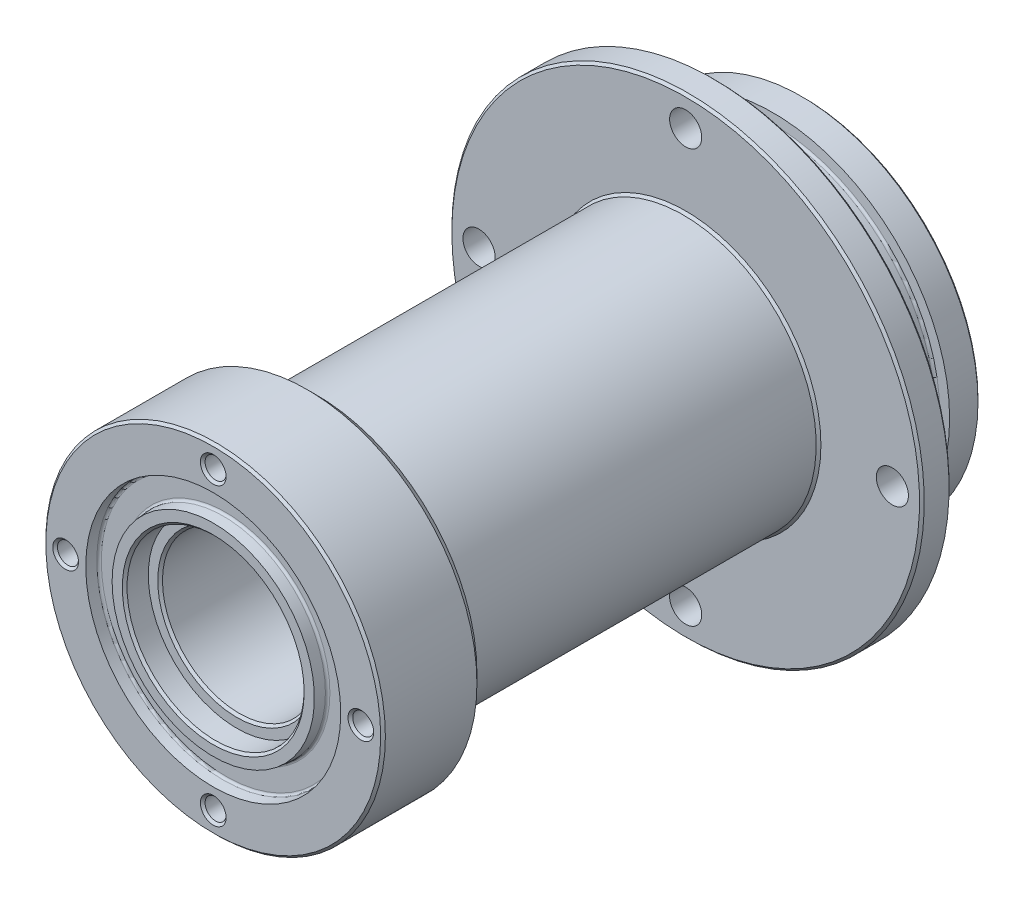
ISO-10303-21;
HEADER;
FILE_DESCRIPTION(('STEP AP214'),'2;1');
FILE_NAME('part.step','',(''),(''),'','','');
FILE_SCHEMA(('AUTOMOTIVE_DESIGN { 1 0 10303 214 1 1 1 1 }'));
ENDSEC;
DATA;
#1=APPLICATION_CONTEXT('core data for automotive mechanical design processes');
#2=APPLICATION_PROTOCOL_DEFINITION('international standard','automotive_design',2000,#1);
#3=PRODUCT_CONTEXT('',#1,'mechanical');
#4=PRODUCT('Part','Part','',(#3));
#5=PRODUCT_RELATED_PRODUCT_CATEGORY('part','',(#4));
#6=PRODUCT_DEFINITION_FORMATION('','',#4);
#7=PRODUCT_DEFINITION_CONTEXT('part definition',#1,'design');
#8=PRODUCT_DEFINITION('design','',#6,#7);
#9=PRODUCT_DEFINITION_SHAPE('','',#8);
#10=(LENGTH_UNIT() NAMED_UNIT(*) SI_UNIT(.MILLI.,.METRE.));
#11=(NAMED_UNIT(*) PLANE_ANGLE_UNIT() SI_UNIT($,.RADIAN.));
#12=(NAMED_UNIT(*) SI_UNIT($,.STERADIAN.) SOLID_ANGLE_UNIT());
#13=UNCERTAINTY_MEASURE_WITH_UNIT(LENGTH_MEASURE(1.E-05),#10,'distance_accuracy_value','');
#14=(GEOMETRIC_REPRESENTATION_CONTEXT(3) GLOBAL_UNCERTAINTY_ASSIGNED_CONTEXT((#13)) GLOBAL_UNIT_ASSIGNED_CONTEXT((#10,
#11,#12)) REPRESENTATION_CONTEXT('',''));
#15=CARTESIAN_POINT('',(0.,0.,0.));
#16=DIRECTION('',(0.,0.,1.));
#17=DIRECTION('',(1.,0.,0.));
#18=AXIS2_PLACEMENT_3D('',#15,#16,#17);
#19=CARTESIAN_POINT('',(0.,0.,63.5));
#20=DIRECTION('',(0.,0.,-1.));
#21=DIRECTION('',(-1.,0.,0.));
#22=AXIS2_PLACEMENT_3D('',#19,#20,#21);
#23=CYLINDRICAL_SURFACE('',#22,7.9883);
#24=CARTESIAN_POINT('',(0.,0.,0.254000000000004));
#25=DIRECTION('',(0.,0.,1.));
#26=DIRECTION('',(1.,0.,0.));
#27=AXIS2_PLACEMENT_3D('',#24,#25,#26);
#28=CIRCLE('',#27,7.9883);
#29=CARTESIAN_POINT('',(7.9883,0.,0.254000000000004));
#30=VERTEX_POINT('',#29);
#31=EDGE_CURVE('E75',#30,#30,#28,.F.);
#32=ORIENTED_EDGE('',*,*,#31,.T.);
#33=EDGE_LOOP('',(#32));
#34=FACE_BOUND('',#33,.T.);
#35=CARTESIAN_POINT('',(0.,0.,19.05));
#36=DIRECTION('',(0.,0.,1.));
#37=DIRECTION('',(1.,0.,0.));
#38=AXIS2_PLACEMENT_3D('',#35,#36,#37);
#39=CIRCLE('',#38,7.9883);
#40=CARTESIAN_POINT('',(7.9883,0.,19.05));
#41=VERTEX_POINT('',#40);
#42=EDGE_CURVE('E50',#41,#41,#39,.T.);
#43=ORIENTED_EDGE('',*,*,#42,.T.);
#44=EDGE_LOOP('',(#43));
#45=FACE_BOUND('',#44,.T.);
#46=ADVANCED_FACE('F32',(#34,#45),#23,.F.);
#47=CARTESIAN_POINT('',(0.,0.,60.96));
#48=DIRECTION('',(0.,0.,1.));
#49=DIRECTION('',(1.,0.,0.));
#50=AXIS2_PLACEMENT_3D('',#47,#48,#49);
#51=PLANE('',#50);
#52=CARTESIAN_POINT('',(0.,0.,60.96));
#53=DIRECTION('',(0.,0.,1.));
#54=DIRECTION('',(1.,0.,0.));
#55=AXIS2_PLACEMENT_3D('',#52,#53,#54);
#56=CIRCLE('',#55,8.509);
#57=CARTESIAN_POINT('',(8.509,0.,60.96));
#58=VERTEX_POINT('',#57);
#59=EDGE_CURVE('E39',#58,#58,#56,.F.);
#60=ORIENTED_EDGE('',*,*,#59,.T.);
#61=EDGE_LOOP('',(#60));
#62=FACE_BOUND('',#61,.T.);
#63=CARTESIAN_POINT('',(0.,0.,60.96));
#64=DIRECTION('',(0.,0.,1.));
#65=DIRECTION('',(1.,0.,0.));
#66=AXIS2_PLACEMENT_3D('',#63,#64,#65);
#67=CIRCLE('',#66,9.525);
#68=CARTESIAN_POINT('',(9.525,0.,60.96));
#69=VERTEX_POINT('',#68);
#70=EDGE_CURVE('E159',#69,#69,#67,.T.);
#71=ORIENTED_EDGE('',*,*,#70,.T.);
#72=EDGE_LOOP('',(#71));
#73=FACE_BOUND('',#72,.T.);
#74=ADVANCED_FACE('F231',(#62,#73),#51,.T.);
#75=CARTESIAN_POINT('',(0.,0.,-3.577141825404));
#76=DIRECTION('',(0.,0.,-1.));
#77=DIRECTION('',(-1.,0.,0.));
#78=AXIS2_PLACEMENT_3D('',#75,#76,#77);
#79=CYLINDRICAL_SURFACE('',#78,18.9865);
#80=CARTESIAN_POINT('',(0.,0.,0.253999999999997));
#81=DIRECTION('',(0.,0.,1.));
#82=DIRECTION('',(1.,0.,0.));
#83=AXIS2_PLACEMENT_3D('',#80,#81,#82);
#84=CIRCLE('',#83,18.9865);
#85=CARTESIAN_POINT('',(18.9865,0.,0.253999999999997));
#86=VERTEX_POINT('',#85);
#87=EDGE_CURVE('E78',#86,#86,#84,.T.);
#88=ORIENTED_EDGE('',*,*,#87,.T.);
#89=EDGE_LOOP('',(#88));
#90=FACE_BOUND('',#89,.T.);
#91=CARTESIAN_POINT('',(0.,0.,3.30520920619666));
#92=DIRECTION('',(0.,0.,-1.));
#93=DIRECTION('',(-1.,0.,0.));
#94=AXIS2_PLACEMENT_3D('',#91,#92,#93);
#95=CIRCLE('',#94,18.9865);
#96=CARTESIAN_POINT('',(-18.9865,0.,3.30520920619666));
#97=VERTEX_POINT('',#96);
#98=EDGE_CURVE('E88',#97,#97,#95,.F.);
#99=ORIENTED_EDGE('',*,*,#98,.F.);
#100=EDGE_LOOP('',(#99));
#101=FACE_BOUND('',#100,.T.);
#102=ADVANCED_FACE('F237',(#90,#101),#79,.T.);
#103=CARTESIAN_POINT('',(0.,0.,63.5));
#104=DIRECTION('',(0.,0.,1.));
#105=DIRECTION('',(1.,0.,0.));
#106=AXIS2_PLACEMENT_3D('',#103,#104,#105);
#107=PLANE('',#106);
#108=CARTESIAN_POINT('',(0.,0.,63.5));
#109=DIRECTION('',(0.,0.,1.));
#110=DIRECTION('',(1.,0.,0.));
#111=AXIS2_PLACEMENT_3D('',#108,#109,#110);
#112=CIRCLE('',#111,9.779);
#113=CARTESIAN_POINT('',(9.779,0.,63.5));
#114=VERTEX_POINT('',#113);
#115=EDGE_CURVE('E101',#114,#114,#112,.F.);
#116=ORIENTED_EDGE('',*,*,#115,.T.);
#117=EDGE_LOOP('',(#116));
#118=FACE_BOUND('',#117,.T.);
#119=CARTESIAN_POINT('',(0.,0.,63.5));
#120=DIRECTION('',(0.,0.,-1.));
#121=DIRECTION('',(-1.,0.,0.));
#122=AXIS2_PLACEMENT_3D('',#119,#120,#121);
#123=CIRCLE('',#122,10.8775303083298);
#124=CARTESIAN_POINT('',(-10.8775303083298,0.,63.5));
#125=VERTEX_POINT('',#124);
#126=EDGE_CURVE('E144',#125,#125,#123,.T.);
#127=ORIENTED_EDGE('',*,*,#126,.F.);
#128=EDGE_LOOP('',(#127));
#129=FACE_BOUND('',#128,.T.);
#130=ADVANCED_FACE('F251',(#118,#129),#107,.T.);
#131=CARTESIAN_POINT('',(-15.875,0.,63.5));
#132=DIRECTION('',(0.,0.,1.));
#133=DIRECTION('',(1.,0.,0.));
#134=AXIS2_PLACEMENT_3D('',#131,#132,#133);
#135=CIRCLE('',#134,1.3843);
#136=CARTESIAN_POINT('',(-14.4907,0.,63.5));
#137=VERTEX_POINT('',#136);
#138=EDGE_CURVE('E123',#137,#137,#135,.F.);
#139=ORIENTED_EDGE('',*,*,#138,.T.);
#140=EDGE_LOOP('',(#139));
#141=FACE_BOUND('',#140,.T.);
#142=CARTESIAN_POINT('',(0.,-15.875,63.5));
#143=DIRECTION('',(0.,0.,1.));
#144=DIRECTION('',(1.,0.,0.));
#145=AXIS2_PLACEMENT_3D('',#142,#143,#144);
#146=CIRCLE('',#145,1.3843);
#147=CARTESIAN_POINT('',(1.3843,-15.875,63.5));
#148=VERTEX_POINT('',#147);
#149=EDGE_CURVE('E126',#148,#148,#146,.F.);
#150=ORIENTED_EDGE('',*,*,#149,.T.);
#151=EDGE_LOOP('',(#150));
#152=FACE_BOUND('',#151,.T.);
#153=CARTESIAN_POINT('',(15.875,0.,63.5));
#154=DIRECTION('',(0.,0.,1.));
#155=DIRECTION('',(1.,0.,0.));
#156=AXIS2_PLACEMENT_3D('',#153,#154,#155);
#157=CIRCLE('',#156,1.3843);
#158=CARTESIAN_POINT('',(17.2593,0.,63.5));
#159=VERTEX_POINT('',#158);
#160=EDGE_CURVE('E129',#159,#159,#157,.F.);
#161=ORIENTED_EDGE('',*,*,#160,.T.);
#162=EDGE_LOOP('',(#161));
#163=FACE_BOUND('',#162,.T.);
#164=CARTESIAN_POINT('',(0.,15.875,63.5));
#165=DIRECTION('',(0.,0.,1.));
#166=DIRECTION('',(1.,0.,0.));
#167=AXIS2_PLACEMENT_3D('',#164,#165,#166);
#168=CIRCLE('',#167,1.3843);
#169=CARTESIAN_POINT('',(1.3843,15.875,63.5));
#170=VERTEX_POINT('',#169);
#171=EDGE_CURVE('E132',#170,#170,#168,.F.);
#172=ORIENTED_EDGE('',*,*,#171,.T.);
#173=EDGE_LOOP('',(#172));
#174=FACE_BOUND('',#173,.T.);
#175=CARTESIAN_POINT('',(0.,0.,63.5));
#176=DIRECTION('',(0.,0.,1.));
#177=DIRECTION('',(1.,0.,0.));
#178=AXIS2_PLACEMENT_3D('',#175,#176,#177);
#179=CIRCLE('',#178,18.00225);
#180=CARTESIAN_POINT('',(18.00225,0.,63.5));
#181=VERTEX_POINT('',#180);
#182=EDGE_CURVE('E135',#181,#181,#179,.T.);
#183=ORIENTED_EDGE('',*,*,#182,.T.);
#184=EDGE_LOOP('',(#183));
#185=FACE_BOUND('',#184,.T.);
#186=CARTESIAN_POINT('',(0.,0.,63.5));
#187=DIRECTION('',(0.,0.,-1.));
#188=DIRECTION('',(-1.,0.,0.));
#189=AXIS2_PLACEMENT_3D('',#186,#187,#188);
#190=CIRCLE('',#189,13.7096696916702);
#191=CARTESIAN_POINT('',(-13.7096696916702,0.,63.5));
#192=VERTEX_POINT('',#191);
#193=EDGE_CURVE('E147',#192,#192,#190,.T.);
#194=ORIENTED_EDGE('',*,*,#193,.T.);
#195=EDGE_LOOP('',(#194));
#196=FACE_BOUND('',#195,.T.);
#197=ADVANCED_FACE('F248',(#141,#152,#163,#174,#185,#196),#107,.T.);
#198=CARTESIAN_POINT('',(0.,0.,0.));
#199=DIRECTION('',(0.,0.,1.));
#200=DIRECTION('',(1.,0.,0.));
#201=AXIS2_PLACEMENT_3D('',#198,#199,#200);
#202=PLANE('',#201);
#203=CARTESIAN_POINT('',(0.,0.,0.));
#204=DIRECTION('',(0.,0.,1.));
#205=DIRECTION('',(1.,0.,0.));
#206=AXIS2_PLACEMENT_3D('',#203,#204,#205);
#207=CIRCLE('',#206,18.7325);
#208=CARTESIAN_POINT('',(18.7325,0.,0.));
#209=VERTEX_POINT('',#208);
#210=EDGE_CURVE('E81',#209,#209,#207,.F.);
#211=ORIENTED_EDGE('',*,*,#210,.T.);
#212=EDGE_LOOP('',(#211));
#213=FACE_BOUND('',#212,.T.);
#214=CARTESIAN_POINT('',(0.,0.,0.));
#215=DIRECTION('',(0.,0.,1.));
#216=DIRECTION('',(1.,0.,0.));
#217=AXIS2_PLACEMENT_3D('',#214,#215,#216);
#218=CIRCLE('',#217,8.2423);
#219=CARTESIAN_POINT('',(8.2423,0.,0.));
#220=VERTEX_POINT('',#219);
#221=EDGE_CURVE('E84',#220,#220,#218,.T.);
#222=ORIENTED_EDGE('',*,*,#221,.T.);
#223=EDGE_LOOP('',(#222));
#224=FACE_BOUND('',#223,.T.);
#225=ADVANCED_FACE('F244',(#213,#224),#202,.F.);
#226=CARTESIAN_POINT('',(0.,0.,63.5));
#227=DIRECTION('',(0.,0.,-1.));
#228=DIRECTION('',(-1.,0.,0.));
#229=AXIS2_PLACEMENT_3D('',#226,#227,#228);
#230=CYLINDRICAL_SURFACE('',#229,18.25625);
#231=CARTESIAN_POINT('',(0.,0.,53.4035));
#232=DIRECTION('',(0.,0.,1.));
#233=DIRECTION('',(1.,0.,0.));
#234=AXIS2_PLACEMENT_3D('',#231,#232,#233);
#235=CIRCLE('',#234,18.25625);
#236=CARTESIAN_POINT('',(18.25625,0.,53.4035));
#237=VERTEX_POINT('',#236);
#238=EDGE_CURVE('E98',#237,#237,#235,.T.);
#239=ORIENTED_EDGE('',*,*,#238,.T.);
#240=EDGE_LOOP('',(#239));
#241=FACE_BOUND('',#240,.T.);
#242=CARTESIAN_POINT('',(0.,0.,63.246));
#243=DIRECTION('',(0.,0.,1.));
#244=DIRECTION('',(1.,0.,0.));
#245=AXIS2_PLACEMENT_3D('',#242,#243,#244);
#246=CIRCLE('',#245,18.25625);
#247=CARTESIAN_POINT('',(18.25625,0.,63.246));
#248=VERTEX_POINT('',#247);
#249=EDGE_CURVE('E111',#248,#248,#246,.F.);
#250=ORIENTED_EDGE('',*,*,#249,.T.);
#251=EDGE_LOOP('',(#250));
#252=FACE_BOUND('',#251,.T.);
#253=ADVANCED_FACE('F247',(#241,#252),#230,.T.);
#254=CARTESIAN_POINT('',(0.,15.875,50.8));
#255=DIRECTION('',(0.,0.,1.));
#256=DIRECTION('',(1.,0.,0.));
#257=AXIS2_PLACEMENT_3D('',#254,#255,#256);
#258=CYLINDRICAL_SURFACE('',#257,1.1303);
#259=CARTESIAN_POINT('',(0.,15.875,52.3875));
#260=DIRECTION('',(0.,0.,1.));
#261=DIRECTION('',(1.,0.,0.));
#262=AXIS2_PLACEMENT_3D('',#259,#260,#261);
#263=CIRCLE('',#262,1.1303);
#264=CARTESIAN_POINT('',(1.1303,15.875,52.3875));
#265=VERTEX_POINT('',#264);
#266=EDGE_CURVE('E162',#265,#265,#263,.F.);
#267=ORIENTED_EDGE('',*,*,#266,.T.);
#268=EDGE_LOOP('',(#267));
#269=FACE_BOUND('',#268,.T.);
#270=CARTESIAN_POINT('',(0.,15.875,63.246));
#271=DIRECTION('',(0.,0.,1.));
#272=DIRECTION('',(1.,0.,0.));
#273=AXIS2_PLACEMENT_3D('',#270,#271,#272);
#274=CIRCLE('',#273,1.1303);
#275=CARTESIAN_POINT('',(1.1303,15.875,63.246));
#276=VERTEX_POINT('',#275);
#277=EDGE_CURVE('E114',#276,#276,#274,.T.);
#278=ORIENTED_EDGE('',*,*,#277,.T.);
#279=EDGE_LOOP('',(#278));
#280=FACE_BOUND('',#279,.T.);
#281=ADVANCED_FACE('F242',(#269,#280),#258,.F.);
#282=CARTESIAN_POINT('',(15.875,0.,50.8));
#283=DIRECTION('',(0.,0.,1.));
#284=DIRECTION('',(1.,0.,0.));
#285=AXIS2_PLACEMENT_3D('',#282,#283,#284);
#286=CYLINDRICAL_SURFACE('',#285,1.1303);
#287=CARTESIAN_POINT('',(15.875,0.,52.3875));
#288=DIRECTION('',(0.,0.,1.));
#289=DIRECTION('',(1.,0.,0.));
#290=AXIS2_PLACEMENT_3D('',#287,#288,#289);
#291=CIRCLE('',#290,1.1303);
#292=CARTESIAN_POINT('',(17.0053,0.,52.3875));
#293=VERTEX_POINT('',#292);
#294=EDGE_CURVE('E165',#293,#293,#291,.F.);
#295=ORIENTED_EDGE('',*,*,#294,.T.);
#296=EDGE_LOOP('',(#295));
#297=FACE_BOUND('',#296,.T.);
#298=CARTESIAN_POINT('',(15.875,0.,63.246));
#299=DIRECTION('',(0.,0.,1.));
#300=DIRECTION('',(1.,0.,0.));
#301=AXIS2_PLACEMENT_3D('',#298,#299,#300);
#302=CIRCLE('',#301,1.1303);
#303=CARTESIAN_POINT('',(17.0053,0.,63.246));
#304=VERTEX_POINT('',#303);
#305=EDGE_CURVE('E117',#304,#304,#302,.T.);
#306=ORIENTED_EDGE('',*,*,#305,.T.);
#307=EDGE_LOOP('',(#306));
#308=FACE_BOUND('',#307,.T.);
#309=ADVANCED_FACE('F258',(#297,#308),#286,.F.);
#310=CARTESIAN_POINT('',(0.,-15.875,50.8));
#311=DIRECTION('',(0.,0.,1.));
#312=DIRECTION('',(1.,0.,0.));
#313=AXIS2_PLACEMENT_3D('',#310,#311,#312);
#314=CYLINDRICAL_SURFACE('',#313,1.1303);
#315=CARTESIAN_POINT('',(0.,-15.875,52.3875));
#316=DIRECTION('',(0.,0.,1.));
#317=DIRECTION('',(1.,0.,0.));
#318=AXIS2_PLACEMENT_3D('',#315,#316,#317);
#319=CIRCLE('',#318,1.1303);
#320=CARTESIAN_POINT('',(1.1303,-15.875,52.3875));
#321=VERTEX_POINT('',#320);
#322=EDGE_CURVE('E105',#321,#321,#319,.F.);
#323=ORIENTED_EDGE('',*,*,#322,.T.);
#324=EDGE_LOOP('',(#323));
#325=FACE_BOUND('',#324,.T.);
#326=CARTESIAN_POINT('',(0.,-15.875,63.246));
#327=DIRECTION('',(0.,0.,1.));
#328=DIRECTION('',(1.,0.,0.));
#329=AXIS2_PLACEMENT_3D('',#326,#327,#328);
#330=CIRCLE('',#329,1.1303);
#331=CARTESIAN_POINT('',(1.1303,-15.875,63.246));
#332=VERTEX_POINT('',#331);
#333=EDGE_CURVE('E120',#332,#332,#330,.T.);
#334=ORIENTED_EDGE('',*,*,#333,.T.);
#335=EDGE_LOOP('',(#334));
#336=FACE_BOUND('',#335,.T.);
#337=ADVANCED_FACE('F338',(#325,#336),#314,.F.);
#338=CARTESIAN_POINT('',(-15.875,0.,50.8));
#339=DIRECTION('',(0.,0.,1.));
#340=DIRECTION('',(1.,0.,0.));
#341=AXIS2_PLACEMENT_3D('',#338,#339,#340);
#342=CYLINDRICAL_SURFACE('',#341,1.1303);
#343=CARTESIAN_POINT('',(-15.875,0.,52.3875));
#344=DIRECTION('',(0.,0.,1.));
#345=DIRECTION('',(1.,0.,0.));
#346=AXIS2_PLACEMENT_3D('',#343,#344,#345);
#347=CIRCLE('',#346,1.1303);
#348=CARTESIAN_POINT('',(-14.7447,0.,52.3875));
#349=VERTEX_POINT('',#348);
#350=EDGE_CURVE('E102',#349,#349,#347,.F.);
#351=ORIENTED_EDGE('',*,*,#350,.T.);
#352=EDGE_LOOP('',(#351));
#353=FACE_BOUND('',#352,.T.);
#354=CARTESIAN_POINT('',(-15.875,0.,63.246));
#355=DIRECTION('',(0.,0.,1.));
#356=DIRECTION('',(1.,0.,0.));
#357=AXIS2_PLACEMENT_3D('',#354,#355,#356);
#358=CIRCLE('',#357,1.1303);
#359=CARTESIAN_POINT('',(-14.7447,0.,63.246));
#360=VERTEX_POINT('',#359);
#361=EDGE_CURVE('E138',#360,#360,#358,.T.);
#362=ORIENTED_EDGE('',*,*,#361,.T.);
#363=EDGE_LOOP('',(#362));
#364=FACE_BOUND('',#363,.T.);
#365=ADVANCED_FACE('F298',(#353,#364),#342,.F.);
#366=CARTESIAN_POINT('',(0.,0.,62.4332));
#367=DIRECTION('',(0.,0.,-1.));
#368=DIRECTION('',(-1.,0.,0.));
#369=AXIS2_PLACEMENT_3D('',#366,#367,#368);
#370=TOROIDAL_SURFACE('',#369,11.2258334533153,0.253999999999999);
#371=CARTESIAN_POINT('',(0.,0.,62.1792));
#372=DIRECTION('',(0.,0.,-1.));
#373=DIRECTION('',(-1.,0.,0.));
#374=AXIS2_PLACEMENT_3D('',#371,#372,#373);
#375=CIRCLE('',#374,11.2258334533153);
#376=CARTESIAN_POINT('',(-11.2258334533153,0.,62.1792));
#377=VERTEX_POINT('',#376);
#378=EDGE_CURVE('E156',#377,#377,#375,.T.);
#379=ORIENTED_EDGE('',*,*,#378,.F.);
#380=EDGE_LOOP('',(#379));
#381=FACE_BOUND('',#380,.T.);
#382=CARTESIAN_POINT('',(0.,0.,62.4110624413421));
#383=DIRECTION('',(0.,0.,-1.));
#384=DIRECTION('',(-1.,0.,0.));
#385=AXIS2_PLACEMENT_3D('',#382,#383,#384);
#386=CIRCLE('',#385,10.9728);
#387=CARTESIAN_POINT('',(-10.9728,0.,62.4110624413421));
#388=VERTEX_POINT('',#387);
#389=EDGE_CURVE('E141',#388,#388,#386,.T.);
#390=ORIENTED_EDGE('',*,*,#389,.T.);
#391=EDGE_LOOP('',(#390));
#392=FACE_BOUND('',#391,.T.);
#393=ADVANCED_FACE('F295',(#381,#392),#370,.F.);
#394=CARTESIAN_POINT('',(0.,0.,63.5));
#395=DIRECTION('',(0.,0.,-1.));
#396=DIRECTION('',(-1.,0.,0.));
#397=AXIS2_PLACEMENT_3D('',#394,#395,#396);
#398=CONICAL_SURFACE('',#397,10.8775303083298,0.0872664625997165);
#399=ORIENTED_EDGE('',*,*,#389,.F.);
#400=EDGE_LOOP('',(#399));
#401=FACE_BOUND('',#400,.T.);
#402=ORIENTED_EDGE('',*,*,#126,.T.);
#403=EDGE_LOOP('',(#402));
#404=FACE_BOUND('',#403,.T.);
#405=ADVANCED_FACE('F279',(#401,#404),#398,.T.);
#406=CARTESIAN_POINT('',(0.,0.,62.4110624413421));
#407=DIRECTION('',(0.,0.,1.));
#408=DIRECTION('',(1.,0.,0.));
#409=AXIS2_PLACEMENT_3D('',#406,#407,#408);
#410=CONICAL_SURFACE('',#409,13.6144,0.0872664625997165);
#411=ORIENTED_EDGE('',*,*,#193,.F.);
#412=EDGE_LOOP('',(#411));
#413=FACE_BOUND('',#412,.T.);
#414=CARTESIAN_POINT('',(0.,0.,62.4110624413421));
#415=DIRECTION('',(0.,0.,-1.));
#416=DIRECTION('',(-1.,0.,0.));
#417=AXIS2_PLACEMENT_3D('',#414,#415,#416);
#418=CIRCLE('',#417,13.6144);
#419=CARTESIAN_POINT('',(-13.6144,0.,62.4110624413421));
#420=VERTEX_POINT('',#419);
#421=EDGE_CURVE('E150',#420,#420,#418,.T.);
#422=ORIENTED_EDGE('',*,*,#421,.T.);
#423=EDGE_LOOP('',(#422));
#424=FACE_BOUND('',#423,.T.);
#425=ADVANCED_FACE('F275',(#413,#424),#410,.F.);
#426=CARTESIAN_POINT('',(0.,0.,62.4332));
#427=DIRECTION('',(0.,0.,-1.));
#428=DIRECTION('',(-1.,0.,0.));
#429=AXIS2_PLACEMENT_3D('',#426,#427,#428);
#430=TOROIDAL_SURFACE('',#429,13.3613665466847,0.253999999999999);
#431=ORIENTED_EDGE('',*,*,#421,.F.);
#432=EDGE_LOOP('',(#431));
#433=FACE_BOUND('',#432,.T.);
#434=CARTESIAN_POINT('',(0.,0.,62.1792));
#435=DIRECTION('',(0.,0.,-1.));
#436=DIRECTION('',(-1.,0.,0.));
#437=AXIS2_PLACEMENT_3D('',#434,#435,#436);
#438=CIRCLE('',#437,13.3613665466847);
#439=CARTESIAN_POINT('',(-13.3613665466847,0.,62.1792));
#440=VERTEX_POINT('',#439);
#441=EDGE_CURVE('E153',#440,#440,#438,.T.);
#442=ORIENTED_EDGE('',*,*,#441,.T.);
#443=EDGE_LOOP('',(#442));
#444=FACE_BOUND('',#443,.T.);
#445=ADVANCED_FACE('F278',(#433,#444),#430,.F.);
#446=CARTESIAN_POINT('',(0.,-13.3613665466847,62.1792));
#447=DIRECTION('',(0.,0.,-1.));
#448=DIRECTION('',(-1.,0.,0.));
#449=AXIS2_PLACEMENT_3D('',#446,#447,#448);
#450=PLANE('',#449);
#451=ORIENTED_EDGE('',*,*,#441,.F.);
#452=EDGE_LOOP('',(#451));
#453=FACE_BOUND('',#452,.T.);
#454=ORIENTED_EDGE('',*,*,#378,.T.);
#455=EDGE_LOOP('',(#454));
#456=FACE_BOUND('',#455,.T.);
#457=ADVANCED_FACE('F285',(#453,#456),#450,.F.);
#458=CARTESIAN_POINT('',(0.,0.,60.96));
#459=DIRECTION('',(0.,0.,1.));
#460=DIRECTION('',(1.,0.,0.));
#461=AXIS2_PLACEMENT_3D('',#458,#459,#460);
#462=CYLINDRICAL_SURFACE('',#461,9.525);
#463=CARTESIAN_POINT('',(0.,0.,63.246));
#464=DIRECTION('',(0.,0.,1.));
#465=DIRECTION('',(1.,0.,0.));
#466=AXIS2_PLACEMENT_3D('',#463,#464,#465);
#467=CIRCLE('',#466,9.525);
#468=CARTESIAN_POINT('',(9.525,0.,63.246));
#469=VERTEX_POINT('',#468);
#470=EDGE_CURVE('E108',#469,#469,#467,.T.);
#471=ORIENTED_EDGE('',*,*,#470,.T.);
#472=EDGE_LOOP('',(#471));
#473=FACE_BOUND('',#472,.T.);
#474=ORIENTED_EDGE('',*,*,#70,.F.);
#475=EDGE_LOOP('',(#474));
#476=FACE_BOUND('',#475,.T.);
#477=ADVANCED_FACE('F291',(#473,#476),#462,.F.);
#478=CARTESIAN_POINT('',(-15.875,0.,63.246));
#479=DIRECTION('',(0.,0.,1.));
#480=DIRECTION('',(1.,0.,0.));
#481=AXIS2_PLACEMENT_3D('',#478,#479,#480);
#482=CONICAL_SURFACE('',#481,1.1303,0.785398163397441);
#483=ORIENTED_EDGE('',*,*,#138,.F.);
#484=EDGE_LOOP('',(#483));
#485=FACE_BOUND('',#484,.T.);
#486=ORIENTED_EDGE('',*,*,#361,.F.);
#487=EDGE_LOOP('',(#486));
#488=FACE_BOUND('',#487,.T.);
#489=ADVANCED_FACE('F325',(#485,#488),#482,.F.);
#490=CARTESIAN_POINT('',(0.,-15.875,63.246));
#491=DIRECTION('',(0.,0.,1.));
#492=DIRECTION('',(1.,0.,0.));
#493=AXIS2_PLACEMENT_3D('',#490,#491,#492);
#494=CONICAL_SURFACE('',#493,1.1303,0.785398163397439);
#495=ORIENTED_EDGE('',*,*,#149,.F.);
#496=EDGE_LOOP('',(#495));
#497=FACE_BOUND('',#496,.T.);
#498=ORIENTED_EDGE('',*,*,#333,.F.);
#499=EDGE_LOOP('',(#498));
#500=FACE_BOUND('',#499,.T.);
#501=ADVANCED_FACE('F332',(#497,#500),#494,.F.);
#502=CARTESIAN_POINT('',(15.875,0.,63.246));
#503=DIRECTION('',(0.,0.,1.));
#504=DIRECTION('',(1.,0.,0.));
#505=AXIS2_PLACEMENT_3D('',#502,#503,#504);
#506=CONICAL_SURFACE('',#505,1.1303,0.785398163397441);
#507=ORIENTED_EDGE('',*,*,#160,.F.);
#508=EDGE_LOOP('',(#507));
#509=FACE_BOUND('',#508,.T.);
#510=ORIENTED_EDGE('',*,*,#305,.F.);
#511=EDGE_LOOP('',(#510));
#512=FACE_BOUND('',#511,.T.);
#513=ADVANCED_FACE('F350',(#509,#512),#506,.F.);
#514=CARTESIAN_POINT('',(0.,15.875,63.246));
#515=DIRECTION('',(0.,0.,1.));
#516=DIRECTION('',(1.,0.,0.));
#517=AXIS2_PLACEMENT_3D('',#514,#515,#516);
#518=CONICAL_SURFACE('',#517,1.1303,0.785398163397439);
#519=ORIENTED_EDGE('',*,*,#171,.F.);
#520=EDGE_LOOP('',(#519));
#521=FACE_BOUND('',#520,.T.);
#522=ORIENTED_EDGE('',*,*,#277,.F.);
#523=EDGE_LOOP('',(#522));
#524=FACE_BOUND('',#523,.T.);
#525=ADVANCED_FACE('F268',(#521,#524),#518,.F.);
#526=CARTESIAN_POINT('',(0.,0.,63.5));
#527=DIRECTION('',(0.,0.,-1.));
#528=DIRECTION('',(-1.,0.,0.));
#529=AXIS2_PLACEMENT_3D('',#526,#527,#528);
#530=CONICAL_SURFACE('',#529,18.00225,0.785398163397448);
#531=ORIENTED_EDGE('',*,*,#249,.F.);
#532=EDGE_LOOP('',(#531));
#533=FACE_BOUND('',#532,.T.);
#534=ORIENTED_EDGE('',*,*,#182,.F.);
#535=EDGE_LOOP('',(#534));
#536=FACE_BOUND('',#535,.T.);
#537=ADVANCED_FACE('F264',(#533,#536),#530,.T.);
#538=CARTESIAN_POINT('',(0.,0.,63.246));
#539=DIRECTION('',(0.,0.,1.));
#540=DIRECTION('',(1.,0.,0.));
#541=AXIS2_PLACEMENT_3D('',#538,#539,#540);
#542=CONICAL_SURFACE('',#541,9.525,0.785398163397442);
#543=ORIENTED_EDGE('',*,*,#115,.F.);
#544=EDGE_LOOP('',(#543));
#545=FACE_BOUND('',#544,.T.);
#546=ORIENTED_EDGE('',*,*,#470,.F.);
#547=EDGE_LOOP('',(#546));
#548=FACE_BOUND('',#547,.T.);
#549=ADVANCED_FACE('F267',(#545,#548),#542,.F.);
#550=CARTESIAN_POINT('',(0.,21.2504263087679,12.7));
#551=DIRECTION('',(0.,0.,-1.));
#552=DIRECTION('',(-1.,0.,0.));
#553=AXIS2_PLACEMENT_3D('',#550,#551,#552);
#554=PLANE('',#553);
#555=CARTESIAN_POINT('',(-22.225,0.,12.7));
#556=DIRECTION('',(0.,0.,-1.));
#557=DIRECTION('',(-1.,0.,0.));
#558=AXIS2_PLACEMENT_3D('',#555,#556,#557);
#559=CIRCLE('',#558,1.7272);
#560=CARTESIAN_POINT('',(-23.9522,0.,12.7));
#561=VERTEX_POINT('',#560);
#562=EDGE_CURVE('E201',#561,#561,#559,.T.);
#563=ORIENTED_EDGE('',*,*,#562,.T.);
#564=EDGE_LOOP('',(#563));
#565=FACE_BOUND('',#564,.T.);
#566=CARTESIAN_POINT('',(0.,-22.225,12.7));
#567=DIRECTION('',(0.,0.,-1.));
#568=DIRECTION('',(-1.,0.,0.));
#569=AXIS2_PLACEMENT_3D('',#566,#567,#568);
#570=CIRCLE('',#569,1.7272);
#571=CARTESIAN_POINT('',(-1.72720000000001,-22.225,12.7));
#572=VERTEX_POINT('',#571);
#573=EDGE_CURVE('E195',#572,#572,#570,.T.);
#574=ORIENTED_EDGE('',*,*,#573,.T.);
#575=EDGE_LOOP('',(#574));
#576=FACE_BOUND('',#575,.T.);
#577=CARTESIAN_POINT('',(22.225,0.,12.7));
#578=DIRECTION('',(0.,0.,-1.));
#579=DIRECTION('',(-1.,0.,0.));
#580=AXIS2_PLACEMENT_3D('',#577,#578,#579);
#581=CIRCLE('',#580,1.7272);
#582=CARTESIAN_POINT('',(20.4978,0.,12.7));
#583=VERTEX_POINT('',#582);
#584=EDGE_CURVE('E189',#583,#583,#581,.T.);
#585=ORIENTED_EDGE('',*,*,#584,.T.);
#586=EDGE_LOOP('',(#585));
#587=FACE_BOUND('',#586,.T.);
#588=CARTESIAN_POINT('',(0.,22.225,12.7));
#589=DIRECTION('',(0.,0.,-1.));
#590=DIRECTION('',(-1.,0.,0.));
#591=AXIS2_PLACEMENT_3D('',#588,#589,#590);
#592=CIRCLE('',#591,1.7272);
#593=CARTESIAN_POINT('',(-1.72720000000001,22.225,12.7));
#594=VERTEX_POINT('',#593);
#595=EDGE_CURVE('E183',#594,#594,#592,.T.);
#596=ORIENTED_EDGE('',*,*,#595,.T.);
#597=EDGE_LOOP('',(#596));
#598=FACE_BOUND('',#597,.T.);
#599=CARTESIAN_POINT('',(0.,0.,12.7));
#600=DIRECTION('',(0.,0.,-1.));
#601=DIRECTION('',(-1.,0.,0.));
#602=AXIS2_PLACEMENT_3D('',#599,#600,#601);
#603=CIRCLE('',#602,25.146);
#604=CARTESIAN_POINT('',(-25.146,0.,12.7));
#605=VERTEX_POINT('',#604);
#606=EDGE_CURVE('E60',#605,#605,#603,.F.);
#607=ORIENTED_EDGE('',*,*,#606,.T.);
#608=EDGE_LOOP('',(#607));
#609=FACE_BOUND('',#608,.T.);
#610=CARTESIAN_POINT('',(0.,0.,12.7));
#611=DIRECTION('',(0.,0.,-1.));
#612=DIRECTION('',(-1.,0.,0.));
#613=AXIS2_PLACEMENT_3D('',#610,#611,#612);
#614=CIRCLE('',#613,14.5415);
#615=CARTESIAN_POINT('',(-14.5415,0.,12.7));
#616=VERTEX_POINT('',#615);
#617=EDGE_CURVE('E63',#616,#616,#614,.T.);
#618=ORIENTED_EDGE('',*,*,#617,.T.);
#619=EDGE_LOOP('',(#618));
#620=FACE_BOUND('',#619,.T.);
#621=ADVANCED_FACE('F319',(#565,#576,#587,#598,#609,#620),#554,.F.);
#622=CARTESIAN_POINT('',(0.,21.2504263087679,52.3875));
#623=DIRECTION('',(0.,0.,1.));
#624=DIRECTION('',(1.,0.,0.));
#625=AXIS2_PLACEMENT_3D('',#622,#623,#624);
#626=PLANE('',#625);
#627=CARTESIAN_POINT('',(0.,0.,52.3875));
#628=DIRECTION('',(0.,0.,1.));
#629=DIRECTION('',(1.,0.,0.));
#630=AXIS2_PLACEMENT_3D('',#627,#628,#629);
#631=CIRCLE('',#630,14.5415);
#632=CARTESIAN_POINT('',(14.5415,0.,52.3875));
#633=VERTEX_POINT('',#632);
#634=EDGE_CURVE('E43',#633,#633,#631,.T.);
#635=ORIENTED_EDGE('',*,*,#634,.T.);
#636=EDGE_LOOP('',(#635));
#637=FACE_BOUND('',#636,.T.);
#638=CARTESIAN_POINT('',(0.,0.,52.3875));
#639=DIRECTION('',(0.,0.,1.));
#640=DIRECTION('',(1.,0.,0.));
#641=AXIS2_PLACEMENT_3D('',#638,#639,#640);
#642=CIRCLE('',#641,17.24025);
#643=CARTESIAN_POINT('',(17.24025,0.,52.3875));
#644=VERTEX_POINT('',#643);
#645=EDGE_CURVE('E87',#644,#644,#642,.F.);
#646=ORIENTED_EDGE('',*,*,#645,.T.);
#647=EDGE_LOOP('',(#646));
#648=FACE_BOUND('',#647,.T.);
#649=ORIENTED_EDGE('',*,*,#266,.F.);
#650=EDGE_LOOP('',(#649));
#651=FACE_BOUND('',#650,.T.);
#652=ORIENTED_EDGE('',*,*,#322,.F.);
#653=EDGE_LOOP('',(#652));
#654=FACE_BOUND('',#653,.T.);
#655=ORIENTED_EDGE('',*,*,#350,.F.);
#656=EDGE_LOOP('',(#655));
#657=FACE_BOUND('',#656,.T.);
#658=ORIENTED_EDGE('',*,*,#294,.F.);
#659=EDGE_LOOP('',(#658));
#660=FACE_BOUND('',#659,.T.);
#661=ADVANCED_FACE('F366',(#637,#648,#651,#654,#657,#660),#626,.F.);
#662=CARTESIAN_POINT('',(0.,0.,-3.30643575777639));
#663=DIRECTION('',(0.,0.,-1.));
#664=DIRECTION('',(-1.,0.,0.));
#665=AXIS2_PLACEMENT_3D('',#662,#663,#664);
#666=CYLINDRICAL_SURFACE('',#665,14.2875);
#667=CARTESIAN_POINT('',(0.,0.,52.1335));
#668=DIRECTION('',(0.,0.,1.));
#669=DIRECTION('',(1.,0.,0.));
#670=AXIS2_PLACEMENT_3D('',#667,#668,#669);
#671=CIRCLE('',#670,14.2875);
#672=CARTESIAN_POINT('',(14.2875,0.,52.1335));
#673=VERTEX_POINT('',#672);
#674=EDGE_CURVE('E47',#673,#673,#671,.F.);
#675=ORIENTED_EDGE('',*,*,#674,.T.);
#676=EDGE_LOOP('',(#675));
#677=FACE_BOUND('',#676,.T.);
#678=CARTESIAN_POINT('',(0.,0.,12.954));
#679=DIRECTION('',(0.,0.,-1.));
#680=DIRECTION('',(-1.,0.,0.));
#681=AXIS2_PLACEMENT_3D('',#678,#679,#680);
#682=CIRCLE('',#681,14.2875);
#683=CARTESIAN_POINT('',(-14.2875,0.,12.954));
#684=VERTEX_POINT('',#683);
#685=EDGE_CURVE('E57',#684,#684,#682,.F.);
#686=ORIENTED_EDGE('',*,*,#685,.T.);
#687=EDGE_LOOP('',(#686));
#688=FACE_BOUND('',#687,.T.);
#689=ADVANCED_FACE('F370',(#677,#688),#666,.T.);
#690=CARTESIAN_POINT('',(0.,0.,53.4035));
#691=DIRECTION('',(0.,0.,1.));
#692=DIRECTION('',(1.,0.,0.));
#693=AXIS2_PLACEMENT_3D('',#690,#691,#692);
#694=CONICAL_SURFACE('',#693,18.25625,0.78539816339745);
#695=ORIENTED_EDGE('',*,*,#645,.F.);
#696=EDGE_LOOP('',(#695));
#697=FACE_BOUND('',#696,.T.);
#698=ORIENTED_EDGE('',*,*,#238,.F.);
#699=EDGE_LOOP('',(#698));
#700=FACE_BOUND('',#699,.T.);
#701=ADVANCED_FACE('F374',(#697,#700),#694,.T.);
#702=CARTESIAN_POINT('',(0.,18.9865,9.525));
#703=DIRECTION('',(0.,0.,-1.));
#704=DIRECTION('',(-1.,0.,0.));
#705=AXIS2_PLACEMENT_3D('',#702,#703,#704);
#706=PLANE('',#705);
#707=CARTESIAN_POINT('',(-22.225,0.,9.525));
#708=DIRECTION('',(0.,0.,-1.));
#709=DIRECTION('',(-1.,0.,0.));
#710=AXIS2_PLACEMENT_3D('',#707,#708,#709);
#711=CIRCLE('',#710,1.7272);
#712=CARTESIAN_POINT('',(-23.9522,0.,9.525));
#713=VERTEX_POINT('',#712);
#714=EDGE_CURVE('E52',#713,#713,#711,.T.);
#715=ORIENTED_EDGE('',*,*,#714,.F.);
#716=EDGE_LOOP('',(#715));
#717=FACE_BOUND('',#716,.T.);
#718=CARTESIAN_POINT('',(0.,-22.225,9.525));
#719=DIRECTION('',(0.,0.,-1.));
#720=DIRECTION('',(-1.,0.,0.));
#721=AXIS2_PLACEMENT_3D('',#718,#719,#720);
#722=CIRCLE('',#721,1.7272);
#723=CARTESIAN_POINT('',(-1.72720000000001,-22.225,9.525));
#724=VERTEX_POINT('',#723);
#725=EDGE_CURVE('E198',#724,#724,#722,.T.);
#726=ORIENTED_EDGE('',*,*,#725,.F.);
#727=EDGE_LOOP('',(#726));
#728=FACE_BOUND('',#727,.T.);
#729=CARTESIAN_POINT('',(22.225,0.,9.525));
#730=DIRECTION('',(0.,0.,-1.));
#731=DIRECTION('',(-1.,0.,0.));
#732=AXIS2_PLACEMENT_3D('',#729,#730,#731);
#733=CIRCLE('',#732,1.7272);
#734=CARTESIAN_POINT('',(20.4978,0.,9.525));
#735=VERTEX_POINT('',#734);
#736=EDGE_CURVE('E192',#735,#735,#733,.T.);
#737=ORIENTED_EDGE('',*,*,#736,.F.);
#738=EDGE_LOOP('',(#737));
#739=FACE_BOUND('',#738,.T.);
#740=CARTESIAN_POINT('',(0.,22.225,9.525));
#741=DIRECTION('',(0.,0.,-1.));
#742=DIRECTION('',(-1.,0.,0.));
#743=AXIS2_PLACEMENT_3D('',#740,#741,#742);
#744=CIRCLE('',#743,1.7272);
#745=CARTESIAN_POINT('',(-1.72720000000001,22.225,9.525));
#746=VERTEX_POINT('',#745);
#747=EDGE_CURVE('E186',#746,#746,#744,.T.);
#748=ORIENTED_EDGE('',*,*,#747,.F.);
#749=EDGE_LOOP('',(#748));
#750=FACE_BOUND('',#749,.T.);
#751=CARTESIAN_POINT('',(0.,0.,9.525));
#752=DIRECTION('',(0.,0.,-1.));
#753=DIRECTION('',(-1.,0.,0.));
#754=AXIS2_PLACEMENT_3D('',#751,#752,#753);
#755=CIRCLE('',#754,25.146);
#756=CARTESIAN_POINT('',(-25.146,0.,9.525));
#757=VERTEX_POINT('',#756);
#758=EDGE_CURVE('E72',#757,#757,#755,.T.);
#759=ORIENTED_EDGE('',*,*,#758,.T.);
#760=EDGE_LOOP('',(#759));
#761=FACE_BOUND('',#760,.T.);
#762=CARTESIAN_POINT('',(0.,0.,9.525));
#763=DIRECTION('',(0.,0.,-1.));
#764=DIRECTION('',(-1.,0.,0.));
#765=AXIS2_PLACEMENT_3D('',#762,#763,#764);
#766=CIRCLE('',#765,18.9865);
#767=CARTESIAN_POINT('',(-18.9865,0.,9.525));
#768=VERTEX_POINT('',#767);
#769=EDGE_CURVE('E91',#768,#768,#766,.T.);
#770=ORIENTED_EDGE('',*,*,#769,.F.);
#771=EDGE_LOOP('',(#770));
#772=FACE_BOUND('',#771,.T.);
#773=ADVANCED_FACE('F378',(#717,#728,#739,#750,#761,#772),#706,.T.);
#774=CARTESIAN_POINT('',(0.,0.,5.83794868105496));
#775=DIRECTION('',(0.,0.,1.));
#776=DIRECTION('',(1.,0.,0.));
#777=AXIS2_PLACEMENT_3D('',#774,#775,#776);
#778=CIRCLE('',#777,18.9865);
#779=CARTESIAN_POINT('',(18.9865,0.,5.83794868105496));
#780=VERTEX_POINT('',#779);
#781=EDGE_CURVE('E92',#780,#780,#778,.F.);
#782=ORIENTED_EDGE('',*,*,#781,.F.);
#783=EDGE_LOOP('',(#782));
#784=FACE_BOUND('',#783,.T.);
#785=ORIENTED_EDGE('',*,*,#769,.T.);
#786=EDGE_LOOP('',(#785));
#787=FACE_BOUND('',#786,.T.);
#788=ADVANCED_FACE('F314',(#784,#787),#79,.T.);
#789=CARTESIAN_POINT('',(0.,0.,-3.577141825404));
#790=DIRECTION('',(0.,0.,-1.));
#791=DIRECTION('',(-1.,0.,0.));
#792=AXIS2_PLACEMENT_3D('',#789,#790,#791);
#793=CYLINDRICAL_SURFACE('',#792,25.4);
#794=CARTESIAN_POINT('',(0.,0.,9.779));
#795=DIRECTION('',(0.,0.,-1.));
#796=DIRECTION('',(-1.,0.,0.));
#797=AXIS2_PLACEMENT_3D('',#794,#795,#796);
#798=CIRCLE('',#797,25.4);
#799=CARTESIAN_POINT('',(-25.4,0.,9.779));
#800=VERTEX_POINT('',#799);
#801=EDGE_CURVE('E66',#800,#800,#798,.F.);
#802=ORIENTED_EDGE('',*,*,#801,.T.);
#803=EDGE_LOOP('',(#802));
#804=FACE_BOUND('',#803,.T.);
#805=CARTESIAN_POINT('',(0.,0.,12.446));
#806=DIRECTION('',(0.,0.,-1.));
#807=DIRECTION('',(-1.,0.,0.));
#808=AXIS2_PLACEMENT_3D('',#805,#806,#807);
#809=CIRCLE('',#808,25.4);
#810=CARTESIAN_POINT('',(-25.4,0.,12.446));
#811=VERTEX_POINT('',#810);
#812=EDGE_CURVE('E69',#811,#811,#809,.T.);
#813=ORIENTED_EDGE('',*,*,#812,.T.);
#814=EDGE_LOOP('',(#813));
#815=FACE_BOUND('',#814,.T.);
#816=ADVANCED_FACE('F384',(#804,#815),#793,.T.);
#817=CARTESIAN_POINT('',(0.,0.,3.64351239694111));
#818=DIRECTION('',(0.,0.,1.));
#819=DIRECTION('',(1.,0.,0.));
#820=AXIS2_PLACEMENT_3D('',#817,#818,#819);
#821=TOROIDAL_SURFACE('',#820,18.034,0.254);
#822=CARTESIAN_POINT('',(0.,0.,3.64351239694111));
#823=DIRECTION('',(0.,0.,1.));
#824=DIRECTION('',(1.,0.,0.));
#825=AXIS2_PLACEMENT_3D('',#822,#823,#824);
#826=CIRCLE('',#825,17.78);
#827=CARTESIAN_POINT('',(17.78,0.,3.64351239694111));
#828=VERTEX_POINT('',#827);
#829=EDGE_CURVE('E180',#828,#828,#826,.T.);
#830=ORIENTED_EDGE('',*,*,#829,.F.);
#831=EDGE_LOOP('',(#830));
#832=FACE_BOUND('',#831,.T.);
#833=CARTESIAN_POINT('',(0.,0.,3.39047894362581));
#834=DIRECTION('',(0.,0.,1.));
#835=DIRECTION('',(1.,0.,0.));
#836=AXIS2_PLACEMENT_3D('',#833,#834,#835);
#837=CIRCLE('',#836,18.0118624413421);
#838=CARTESIAN_POINT('',(18.0118624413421,0.,3.39047894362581));
#839=VERTEX_POINT('',#838);
#840=EDGE_CURVE('E95',#839,#839,#837,.T.);
#841=ORIENTED_EDGE('',*,*,#840,.T.);
#842=EDGE_LOOP('',(#841));
#843=FACE_BOUND('',#842,.T.);
#844=ADVANCED_FACE('F388',(#832,#843),#821,.F.);
#845=CARTESIAN_POINT('',(0.,0.,3.29187593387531));
#846=DIRECTION('',(0.,0.,-1.));
#847=DIRECTION('',(-1.,0.,0.));
#848=AXIS2_PLACEMENT_3D('',#845,#846,#847);
#849=CONICAL_SURFACE('',#848,19.1389,1.48352986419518);
#850=ORIENTED_EDGE('',*,*,#98,.T.);
#851=EDGE_LOOP('',(#850));
#852=FACE_BOUND('',#851,.T.);
#853=ORIENTED_EDGE('',*,*,#840,.F.);
#854=EDGE_LOOP('',(#853));
#855=FACE_BOUND('',#854,.T.);
#856=ADVANCED_FACE('F392',(#852,#855),#849,.T.);
#857=CARTESIAN_POINT('',(0.,0.,5.75267894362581));
#858=DIRECTION('',(0.,0.,1.));
#859=DIRECTION('',(1.,0.,0.));
#860=AXIS2_PLACEMENT_3D('',#857,#858,#859);
#861=CONICAL_SURFACE('',#860,18.0118624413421,1.48352986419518);
#862=ORIENTED_EDGE('',*,*,#781,.T.);
#863=EDGE_LOOP('',(#862));
#864=FACE_BOUND('',#863,.T.);
#865=CARTESIAN_POINT('',(0.,0.,5.75267894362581));
#866=DIRECTION('',(0.,0.,1.));
#867=DIRECTION('',(1.,0.,0.));
#868=AXIS2_PLACEMENT_3D('',#865,#866,#867);
#869=CIRCLE('',#868,18.0118624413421);
#870=CARTESIAN_POINT('',(18.0118624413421,0.,5.75267894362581));
#871=VERTEX_POINT('',#870);
#872=EDGE_CURVE('E174',#871,#871,#869,.T.);
#873=ORIENTED_EDGE('',*,*,#872,.T.);
#874=EDGE_LOOP('',(#873));
#875=FACE_BOUND('',#874,.T.);
#876=ADVANCED_FACE('F396',(#864,#875),#861,.T.);
#877=CARTESIAN_POINT('',(0.,0.,5.49964549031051));
#878=DIRECTION('',(0.,0.,1.));
#879=DIRECTION('',(1.,0.,0.));
#880=AXIS2_PLACEMENT_3D('',#877,#878,#879);
#881=TOROIDAL_SURFACE('',#880,18.034,0.254);
#882=ORIENTED_EDGE('',*,*,#872,.F.);
#883=EDGE_LOOP('',(#882));
#884=FACE_BOUND('',#883,.T.);
#885=CARTESIAN_POINT('',(0.,0.,5.49964549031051));
#886=DIRECTION('',(0.,0.,1.));
#887=DIRECTION('',(1.,0.,0.));
#888=AXIS2_PLACEMENT_3D('',#885,#886,#887);
#889=CIRCLE('',#888,17.78);
#890=CARTESIAN_POINT('',(17.78,0.,5.49964549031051));
#891=VERTEX_POINT('',#890);
#892=EDGE_CURVE('E177',#891,#891,#889,.T.);
#893=ORIENTED_EDGE('',*,*,#892,.T.);
#894=EDGE_LOOP('',(#893));
#895=FACE_BOUND('',#894,.T.);
#896=ADVANCED_FACE('F400',(#884,#895),#881,.F.);
#897=CARTESIAN_POINT('',(0.,0.,-53.577141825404));
#898=DIRECTION('',(0.,0.,1.));
#899=DIRECTION('',(1.,0.,0.));
#900=AXIS2_PLACEMENT_3D('',#897,#898,#899);
#901=CYLINDRICAL_SURFACE('',#900,17.78);
#902=ORIENTED_EDGE('',*,*,#892,.F.);
#903=EDGE_LOOP('',(#902));
#904=FACE_BOUND('',#903,.T.);
#905=ORIENTED_EDGE('',*,*,#829,.T.);
#906=EDGE_LOOP('',(#905));
#907=FACE_BOUND('',#906,.T.);
#908=ADVANCED_FACE('F404',(#904,#907),#901,.T.);
#909=CARTESIAN_POINT('',(0.,0.,0.));
#910=DIRECTION('',(0.,0.,1.));
#911=DIRECTION('',(1.,0.,0.));
#912=AXIS2_PLACEMENT_3D('',#909,#910,#911);
#913=CONICAL_SURFACE('',#912,18.7325,0.785398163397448);
#914=ORIENTED_EDGE('',*,*,#87,.F.);
#915=EDGE_LOOP('',(#914));
#916=FACE_BOUND('',#915,.T.);
#917=ORIENTED_EDGE('',*,*,#210,.F.);
#918=EDGE_LOOP('',(#917));
#919=FACE_BOUND('',#918,.T.);
#920=ADVANCED_FACE('F408',(#916,#919),#913,.T.);
#921=CARTESIAN_POINT('',(0.,0.,0.));
#922=DIRECTION('',(0.,0.,-1.));
#923=DIRECTION('',(-1.,0.,0.));
#924=AXIS2_PLACEMENT_3D('',#921,#922,#923);
#925=CONICAL_SURFACE('',#924,8.2423,0.785398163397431);
#926=ORIENTED_EDGE('',*,*,#31,.F.);
#927=EDGE_LOOP('',(#926));
#928=FACE_BOUND('',#927,.T.);
#929=ORIENTED_EDGE('',*,*,#221,.F.);
#930=EDGE_LOOP('',(#929));
#931=FACE_BOUND('',#930,.T.);
#932=ADVANCED_FACE('F412',(#928,#931),#925,.F.);
#933=CARTESIAN_POINT('',(0.,0.,9.525));
#934=DIRECTION('',(0.,0.,1.));
#935=DIRECTION('',(1.,0.,0.));
#936=AXIS2_PLACEMENT_3D('',#933,#934,#935);
#937=CONICAL_SURFACE('',#936,25.146,0.785398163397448);
#938=ORIENTED_EDGE('',*,*,#801,.F.);
#939=EDGE_LOOP('',(#938));
#940=FACE_BOUND('',#939,.T.);
#941=ORIENTED_EDGE('',*,*,#758,.F.);
#942=EDGE_LOOP('',(#941));
#943=FACE_BOUND('',#942,.T.);
#944=ADVANCED_FACE('F416',(#940,#943),#937,.T.);
#945=CARTESIAN_POINT('',(0.,0.,12.446));
#946=DIRECTION('',(0.,0.,-1.));
#947=DIRECTION('',(-1.,0.,0.));
#948=AXIS2_PLACEMENT_3D('',#945,#946,#947);
#949=CONICAL_SURFACE('',#948,25.4,0.785398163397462);
#950=ORIENTED_EDGE('',*,*,#606,.F.);
#951=EDGE_LOOP('',(#950));
#952=FACE_BOUND('',#951,.T.);
#953=ORIENTED_EDGE('',*,*,#812,.F.);
#954=EDGE_LOOP('',(#953));
#955=FACE_BOUND('',#954,.T.);
#956=ADVANCED_FACE('F420',(#952,#955),#949,.T.);
#957=CARTESIAN_POINT('',(0.,0.,52.1335));
#958=DIRECTION('',(0.,0.,1.));
#959=DIRECTION('',(1.,0.,0.));
#960=AXIS2_PLACEMENT_3D('',#957,#958,#959);
#961=CONICAL_SURFACE('',#960,14.2875,0.785398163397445);
#962=ORIENTED_EDGE('',*,*,#634,.F.);
#963=EDGE_LOOP('',(#962));
#964=FACE_BOUND('',#963,.T.);
#965=ORIENTED_EDGE('',*,*,#674,.F.);
#966=EDGE_LOOP('',(#965));
#967=FACE_BOUND('',#966,.T.);
#968=ADVANCED_FACE('F424',(#964,#967),#961,.T.);
#969=CARTESIAN_POINT('',(0.,0.,12.7));
#970=DIRECTION('',(0.,0.,-1.));
#971=DIRECTION('',(-1.,0.,0.));
#972=AXIS2_PLACEMENT_3D('',#969,#970,#971);
#973=CONICAL_SURFACE('',#972,14.5415,0.785398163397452);
#974=ORIENTED_EDGE('',*,*,#685,.F.);
#975=EDGE_LOOP('',(#974));
#976=FACE_BOUND('',#975,.T.);
#977=ORIENTED_EDGE('',*,*,#617,.F.);
#978=EDGE_LOOP('',(#977));
#979=FACE_BOUND('',#978,.T.);
#980=ADVANCED_FACE('F428',(#976,#979),#973,.T.);
#981=CARTESIAN_POINT('',(0.,22.225,63.5));
#982=DIRECTION('',(0.,0.,-1.));
#983=DIRECTION('',(-1.,0.,0.));
#984=AXIS2_PLACEMENT_3D('',#981,#982,#983);
#985=CYLINDRICAL_SURFACE('',#984,1.7272);
#986=ORIENTED_EDGE('',*,*,#747,.T.);
#987=EDGE_LOOP('',(#986));
#988=FACE_BOUND('',#987,.T.);
#989=ORIENTED_EDGE('',*,*,#595,.F.);
#990=EDGE_LOOP('',(#989));
#991=FACE_BOUND('',#990,.T.);
#992=ADVANCED_FACE('F432',(#988,#991),#985,.F.);
#993=CARTESIAN_POINT('',(22.225,0.,63.5));
#994=DIRECTION('',(0.,0.,-1.));
#995=DIRECTION('',(-1.,0.,0.));
#996=AXIS2_PLACEMENT_3D('',#993,#994,#995);
#997=CYLINDRICAL_SURFACE('',#996,1.7272);
#998=ORIENTED_EDGE('',*,*,#736,.T.);
#999=EDGE_LOOP('',(#998));
#1000=FACE_BOUND('',#999,.T.);
#1001=ORIENTED_EDGE('',*,*,#584,.F.);
#1002=EDGE_LOOP('',(#1001));
#1003=FACE_BOUND('',#1002,.T.);
#1004=ADVANCED_FACE('F436',(#1000,#1003),#997,.F.);
#1005=CARTESIAN_POINT('',(0.,-22.225,63.5));
#1006=DIRECTION('',(0.,0.,-1.));
#1007=DIRECTION('',(-1.,0.,0.));
#1008=AXIS2_PLACEMENT_3D('',#1005,#1006,#1007);
#1009=CYLINDRICAL_SURFACE('',#1008,1.7272);
#1010=ORIENTED_EDGE('',*,*,#725,.T.);
#1011=EDGE_LOOP('',(#1010));
#1012=FACE_BOUND('',#1011,.T.);
#1013=ORIENTED_EDGE('',*,*,#573,.F.);
#1014=EDGE_LOOP('',(#1013));
#1015=FACE_BOUND('',#1014,.T.);
#1016=ADVANCED_FACE('F440',(#1012,#1015),#1009,.F.);
#1017=CARTESIAN_POINT('',(-22.225,0.,63.5));
#1018=DIRECTION('',(0.,0.,-1.));
#1019=DIRECTION('',(-1.,0.,0.));
#1020=AXIS2_PLACEMENT_3D('',#1017,#1018,#1019);
#1021=CYLINDRICAL_SURFACE('',#1020,1.7272);
#1022=ORIENTED_EDGE('',*,*,#714,.T.);
#1023=EDGE_LOOP('',(#1022));
#1024=FACE_BOUND('',#1023,.T.);
#1025=ORIENTED_EDGE('',*,*,#562,.F.);
#1026=EDGE_LOOP('',(#1025));
#1027=FACE_BOUND('',#1026,.T.);
#1028=ADVANCED_FACE('F444',(#1024,#1027),#1021,.F.);
#1029=CARTESIAN_POINT('',(0.,0.,19.05));
#1030=DIRECTION('',(0.,0.,1.));
#1031=DIRECTION('',(1.,0.,0.));
#1032=AXIS2_PLACEMENT_3D('',#1029,#1030,#1031);
#1033=PLANE('',#1032);
#1034=ORIENTED_EDGE('',*,*,#42,.F.);
#1035=EDGE_LOOP('',(#1034));
#1036=FACE_BOUND('',#1035,.T.);
#1037=CARTESIAN_POINT('',(0.,0.,19.05));
#1038=DIRECTION('',(0.,0.,-1.));
#1039=DIRECTION('',(-1.,0.,0.));
#1040=AXIS2_PLACEMENT_3D('',#1037,#1038,#1039);
#1041=CIRCLE('',#1040,8.128);
#1042=CARTESIAN_POINT('',(-8.128,0.,19.05));
#1043=VERTEX_POINT('',#1042);
#1044=EDGE_CURVE('E53',#1043,#1043,#1041,.T.);
#1045=ORIENTED_EDGE('',*,*,#1044,.F.);
#1046=EDGE_LOOP('',(#1045));
#1047=FACE_BOUND('',#1046,.T.);
#1048=ADVANCED_FACE('F227',(#1036,#1047),#1033,.T.);
#1049=CARTESIAN_POINT('',(0.,0.,0.));
#1050=DIRECTION('',(0.,0.,-1.));
#1051=DIRECTION('',(-1.,0.,0.));
#1052=AXIS2_PLACEMENT_3D('',#1049,#1050,#1051);
#1053=CYLINDRICAL_SURFACE('',#1052,8.128);
#1054=ORIENTED_EDGE('',*,*,#1044,.T.);
#1055=EDGE_LOOP('',(#1054));
#1056=FACE_BOUND('',#1055,.T.);
#1057=CARTESIAN_POINT('',(0.,0.,25.4));
#1058=DIRECTION('',(0.,0.,-1.));
#1059=DIRECTION('',(-1.,0.,0.));
#1060=AXIS2_PLACEMENT_3D('',#1057,#1058,#1059);
#1061=CIRCLE('',#1060,8.128);
#1062=CARTESIAN_POINT('',(-8.12799999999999,0.,25.4));
#1063=VERTEX_POINT('',#1062);
#1064=EDGE_CURVE('E208',#1063,#1063,#1061,.T.);
#1065=ORIENTED_EDGE('',*,*,#1064,.F.);
#1066=EDGE_LOOP('',(#1065));
#1067=FACE_BOUND('',#1066,.T.);
#1068=ADVANCED_FACE('F219',(#1056,#1067),#1053,.F.);
#1069=CARTESIAN_POINT('',(8.255,0.,25.4));
#1070=DIRECTION('',(0.,0.,1.));
#1071=DIRECTION('',(1.,0.,0.));
#1072=AXIS2_PLACEMENT_3D('',#1069,#1070,#1071);
#1073=PLANE('',#1072);
#1074=ORIENTED_EDGE('',*,*,#1064,.T.);
#1075=EDGE_LOOP('',(#1074));
#1076=FACE_BOUND('',#1075,.T.);
#1077=CARTESIAN_POINT('',(0.,0.,25.4));
#1078=DIRECTION('',(0.,0.,-1.));
#1079=DIRECTION('',(-1.,0.,0.));
#1080=AXIS2_PLACEMENT_3D('',#1077,#1078,#1079);
#1081=CIRCLE('',#1080,8.255);
#1082=CARTESIAN_POINT('',(-8.255,0.,25.4));
#1083=VERTEX_POINT('',#1082);
#1084=EDGE_CURVE('E211',#1083,#1083,#1081,.T.);
#1085=ORIENTED_EDGE('',*,*,#1084,.F.);
#1086=EDGE_LOOP('',(#1085));
#1087=FACE_BOUND('',#1086,.T.);
#1088=ADVANCED_FACE('F217',(#1076,#1087),#1073,.T.);
#1089=CARTESIAN_POINT('',(0.,0.,0.));
#1090=DIRECTION('',(0.,0.,-1.));
#1091=DIRECTION('',(-1.,0.,0.));
#1092=AXIS2_PLACEMENT_3D('',#1089,#1090,#1091);
#1093=CYLINDRICAL_SURFACE('',#1092,8.255);
#1094=CARTESIAN_POINT('',(0.,0.,60.706));
#1095=DIRECTION('',(0.,0.,1.));
#1096=DIRECTION('',(1.,0.,0.));
#1097=AXIS2_PLACEMENT_3D('',#1094,#1095,#1096);
#1098=CIRCLE('',#1097,8.255);
#1099=CARTESIAN_POINT('',(8.25500000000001,0.,60.706));
#1100=VERTEX_POINT('',#1099);
#1101=EDGE_CURVE('E10',#1100,#1100,#1098,.T.);
#1102=ORIENTED_EDGE('',*,*,#1101,.T.);
#1103=EDGE_LOOP('',(#1102));
#1104=FACE_BOUND('',#1103,.T.);
#1105=ORIENTED_EDGE('',*,*,#1084,.T.);
#1106=EDGE_LOOP('',(#1105));
#1107=FACE_BOUND('',#1106,.T.);
#1108=ADVANCED_FACE('F215',(#1104,#1107),#1093,.F.);
#1109=CARTESIAN_POINT('',(0.,0.,60.96));
#1110=DIRECTION('',(0.,0.,1.));
#1111=DIRECTION('',(1.,0.,0.));
#1112=AXIS2_PLACEMENT_3D('',#1109,#1110,#1111);
#1113=CONICAL_SURFACE('',#1112,8.509,0.785398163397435);
#1114=ORIENTED_EDGE('',*,*,#1101,.F.);
#1115=EDGE_LOOP('',(#1114));
#1116=FACE_BOUND('',#1115,.T.);
#1117=ORIENTED_EDGE('',*,*,#59,.F.);
#1118=EDGE_LOOP('',(#1117));
#1119=FACE_BOUND('',#1118,.T.);
#1120=ADVANCED_FACE('F34',(#1116,#1119),#1113,.F.);
#1121=CLOSED_SHELL('',(#46,#74,#102,#130,#197,#225,#253,#281,#309,#337,#365,#393,#405,#425,#445,
#457,#477,#489,#501,#513,#525,#537,#549,#621,#661,#689,#701,#773,#788,#816,#844,#856,#876,#896,
#908,#920,#932,#944,#956,#968,#980,#992,#1004,#1016,#1028,#1048,#1068,#1088,#1108,#1120));
#1122=MANIFOLD_SOLID_BREP('B2',#1121);
#1123=ADVANCED_BREP_SHAPE_REPRESENTATION('',(#18,#1122),#14);
#1124=SHAPE_DEFINITION_REPRESENTATION(#9,#1123);
ENDSEC;
END-ISO-10303-21;
